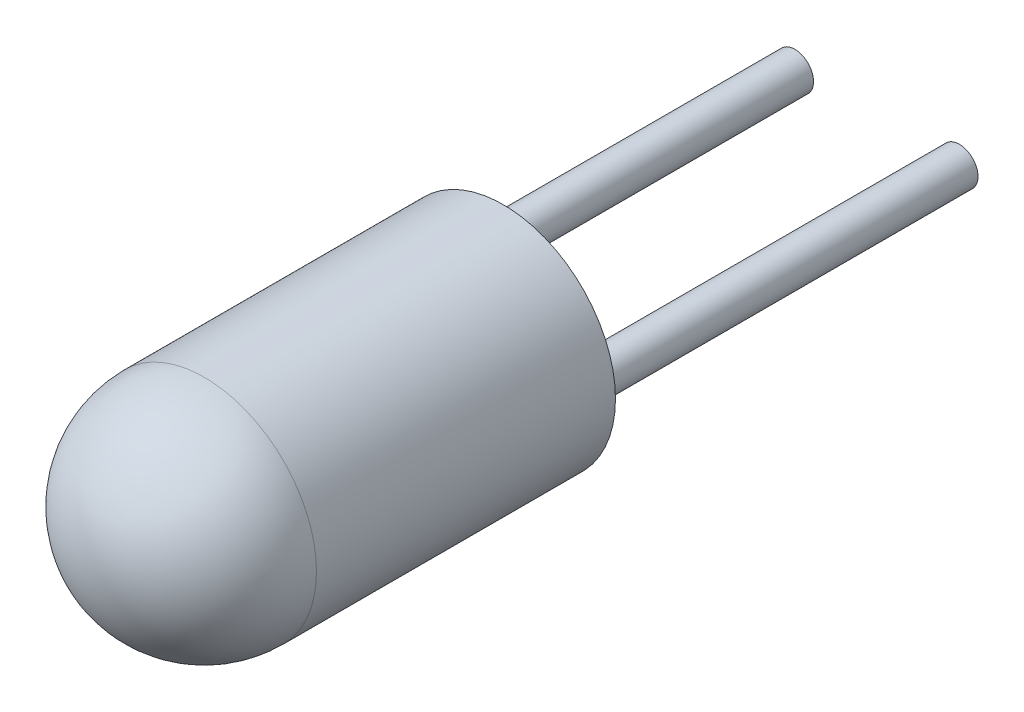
ISO-10303-21;
HEADER;
FILE_DESCRIPTION(('STEP AP214'),'2;1');
FILE_NAME('part.step','',(''),(''),'','','');
FILE_SCHEMA(('AUTOMOTIVE_DESIGN { 1 0 10303 214 1 1 1 1 }'));
ENDSEC;
DATA;
#1=APPLICATION_CONTEXT('core data for automotive mechanical design processes');
#2=APPLICATION_PROTOCOL_DEFINITION('international standard','automotive_design',2000,#1);
#3=PRODUCT_CONTEXT('',#1,'mechanical');
#4=PRODUCT('Part','Part','',(#3));
#5=PRODUCT_RELATED_PRODUCT_CATEGORY('part','',(#4));
#6=PRODUCT_DEFINITION_FORMATION('','',#4);
#7=PRODUCT_DEFINITION_CONTEXT('part definition',#1,'design');
#8=PRODUCT_DEFINITION('design','',#6,#7);
#9=PRODUCT_DEFINITION_SHAPE('','',#8);
#10=(LENGTH_UNIT() NAMED_UNIT(*) SI_UNIT(.MILLI.,.METRE.));
#11=(NAMED_UNIT(*) PLANE_ANGLE_UNIT() SI_UNIT($,.RADIAN.));
#12=(NAMED_UNIT(*) SI_UNIT($,.STERADIAN.) SOLID_ANGLE_UNIT());
#13=UNCERTAINTY_MEASURE_WITH_UNIT(LENGTH_MEASURE(1.E-05),#10,'distance_accuracy_value','');
#14=(GEOMETRIC_REPRESENTATION_CONTEXT(3) GLOBAL_UNCERTAINTY_ASSIGNED_CONTEXT((#13)) GLOBAL_UNIT_ASSIGNED_CONTEXT((#10,
#11,#12)) REPRESENTATION_CONTEXT('',''));
#15=CARTESIAN_POINT('',(0.,0.,0.));
#16=DIRECTION('',(0.,0.,1.));
#17=DIRECTION('',(1.,0.,0.));
#18=AXIS2_PLACEMENT_3D('',#15,#16,#17);
#19=CARTESIAN_POINT('',(0.,0.,0.));
#20=DIRECTION('',(0.,0.,1.));
#21=DIRECTION('',(1.,0.,0.));
#22=AXIS2_PLACEMENT_3D('',#19,#20,#21);
#23=PLANE('',#22);
#24=CARTESIAN_POINT('',(-1.1,0.,0.));
#25=DIRECTION('',(0.,0.,1.));
#26=DIRECTION('',(1.,0.,0.));
#27=AXIS2_PLACEMENT_3D('',#24,#25,#26);
#28=CIRCLE('',#27,0.25);
#29=CARTESIAN_POINT('',(-0.85,0.,0.));
#30=VERTEX_POINT('',#29);
#31=EDGE_CURVE('E36',#30,#30,#28,.F.);
#32=ORIENTED_EDGE('',*,*,#31,.F.);
#33=EDGE_LOOP('',(#32));
#34=FACE_BOUND('',#33,.T.);
#35=CARTESIAN_POINT('',(0.,0.,0.));
#36=DIRECTION('',(0.,0.,1.));
#37=DIRECTION('',(1.,0.,0.));
#38=AXIS2_PLACEMENT_3D('',#35,#36,#37);
#39=CIRCLE('',#38,1.5);
#40=CARTESIAN_POINT('',(1.5,0.,0.));
#41=VERTEX_POINT('',#40);
#42=EDGE_CURVE('E44',#41,#41,#39,.T.);
#43=ORIENTED_EDGE('',*,*,#42,.F.);
#44=EDGE_LOOP('',(#43));
#45=FACE_BOUND('',#44,.T.);
#46=CARTESIAN_POINT('',(1.1,0.,0.));
#47=DIRECTION('',(0.,0.,1.));
#48=DIRECTION('',(1.,0.,0.));
#49=AXIS2_PLACEMENT_3D('',#46,#47,#48);
#50=CIRCLE('',#49,0.25);
#51=CARTESIAN_POINT('',(1.35,0.,0.));
#52=VERTEX_POINT('',#51);
#53=EDGE_CURVE('E10',#52,#52,#50,.F.);
#54=ORIENTED_EDGE('',*,*,#53,.F.);
#55=EDGE_LOOP('',(#54));
#56=FACE_BOUND('',#55,.T.);
#57=ADVANCED_FACE('F29',(#34,#45,#56),#23,.F.);
#58=CARTESIAN_POINT('',(0.,0.,4.));
#59=DIRECTION('',(0.,0.,-1.));
#60=DIRECTION('',(-1.,0.,0.));
#61=AXIS2_PLACEMENT_3D('',#58,#59,#60);
#62=CYLINDRICAL_SURFACE('',#61,1.5);
#63=CARTESIAN_POINT('',(0.,0.,4.));
#64=DIRECTION('',(0.,0.,1.));
#65=DIRECTION('',(1.,0.,0.));
#66=AXIS2_PLACEMENT_3D('',#63,#64,#65);
#67=CIRCLE('',#66,1.5);
#68=CARTESIAN_POINT('',(1.5,0.,4.));
#69=VERTEX_POINT('',#68);
#70=EDGE_CURVE('E40',#69,#69,#67,.T.);
#71=ORIENTED_EDGE('',*,*,#70,.F.);
#72=EDGE_LOOP('',(#71));
#73=FACE_BOUND('',#72,.T.);
#74=ORIENTED_EDGE('',*,*,#42,.T.);
#75=EDGE_LOOP('',(#74));
#76=FACE_BOUND('',#75,.T.);
#77=ADVANCED_FACE('F71',(#73,#76),#62,.T.);
#78=CARTESIAN_POINT('',(0.,0.,4.));
#79=DIRECTION('',(0.,0.,1.));
#80=DIRECTION('',(1.,0.,0.));
#81=AXIS2_PLACEMENT_3D('',#78,#79,#80);
#82=SPHERICAL_SURFACE('',#81,1.5);
#83=ORIENTED_EDGE('',*,*,#70,.T.);
#84=EDGE_LOOP('',(#83));
#85=FACE_BOUND('',#84,.T.);
#86=ADVANCED_FACE('F31',(#85),#82,.T.);
#87=CARTESIAN_POINT('',(-1.1,0.,-5.));
#88=DIRECTION('',(0.,0.,1.));
#89=DIRECTION('',(1.,0.,0.));
#90=AXIS2_PLACEMENT_3D('',#87,#88,#89);
#91=CYLINDRICAL_SURFACE('',#90,0.25);
#92=CARTESIAN_POINT('',(-1.1,0.,-5.));
#93=DIRECTION('',(0.,0.,-1.));
#94=DIRECTION('',(-1.,0.,0.));
#95=AXIS2_PLACEMENT_3D('',#92,#93,#94);
#96=CIRCLE('',#95,0.25);
#97=CARTESIAN_POINT('',(-1.35,0.,-5.));
#98=VERTEX_POINT('',#97);
#99=EDGE_CURVE('E49',#98,#98,#96,.T.);
#100=ORIENTED_EDGE('',*,*,#99,.F.);
#101=EDGE_LOOP('',(#100));
#102=FACE_BOUND('',#101,.T.);
#103=ORIENTED_EDGE('',*,*,#31,.T.);
#104=EDGE_LOOP('',(#103));
#105=FACE_BOUND('',#104,.T.);
#106=ADVANCED_FACE('F67',(#102,#105),#91,.T.);
#107=CARTESIAN_POINT('',(-1.1,0.,-5.));
#108=DIRECTION('',(0.,0.,-1.));
#109=DIRECTION('',(-1.,0.,0.));
#110=AXIS2_PLACEMENT_3D('',#107,#108,#109);
#111=PLANE('',#110);
#112=ORIENTED_EDGE('',*,*,#99,.T.);
#113=EDGE_LOOP('',(#112));
#114=FACE_BOUND('',#113,.T.);
#115=ADVANCED_FACE('F60',(#114),#111,.T.);
#116=CARTESIAN_POINT('',(1.1,0.,-5.));
#117=DIRECTION('',(0.,0.,1.));
#118=DIRECTION('',(1.,0.,0.));
#119=AXIS2_PLACEMENT_3D('',#116,#117,#118);
#120=CYLINDRICAL_SURFACE('',#119,0.25);
#121=CARTESIAN_POINT('',(1.1,0.,-5.));
#122=DIRECTION('',(0.,0.,-1.));
#123=DIRECTION('',(1.,0.,0.));
#124=AXIS2_PLACEMENT_3D('',#121,#122,#123);
#125=CIRCLE('',#124,0.25);
#126=CARTESIAN_POINT('',(1.35,0.,-5.));
#127=VERTEX_POINT('',#126);
#128=EDGE_CURVE('E52',#127,#127,#125,.T.);
#129=ORIENTED_EDGE('',*,*,#128,.F.);
#130=EDGE_LOOP('',(#129));
#131=FACE_BOUND('',#130,.T.);
#132=ORIENTED_EDGE('',*,*,#53,.T.);
#133=EDGE_LOOP('',(#132));
#134=FACE_BOUND('',#133,.T.);
#135=ADVANCED_FACE('F58',(#131,#134),#120,.T.);
#136=CARTESIAN_POINT('',(1.1,0.,-5.));
#137=DIRECTION('',(0.,0.,1.));
#138=DIRECTION('',(1.,0.,0.));
#139=AXIS2_PLACEMENT_3D('',#136,#137,#138);
#140=PLANE('',#139);
#141=ORIENTED_EDGE('',*,*,#128,.T.);
#142=EDGE_LOOP('',(#141));
#143=FACE_BOUND('',#142,.T.);
#144=ADVANCED_FACE('F56',(#143),#140,.F.);
#145=CLOSED_SHELL('',(#57,#77,#86,#106,#115,#135,#144));
#146=MANIFOLD_SOLID_BREP('B2',#145);
#147=ADVANCED_BREP_SHAPE_REPRESENTATION('',(#18,#146),#14);
#148=SHAPE_DEFINITION_REPRESENTATION(#9,#147);
ENDSEC;
END-ISO-10303-21;
